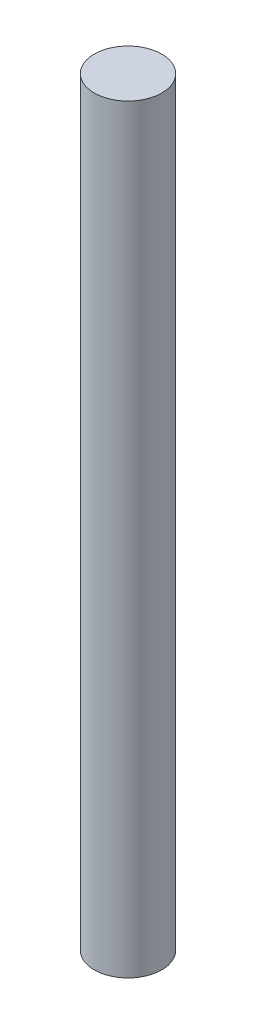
from build123d import *

# Parameters (mm, degrees)
SKETCH1_W = 2
SKETCH1_H = 45


with BuildPart() as part:
    # Sketch1 → Revolve-Thin1 (revolve)
    with BuildSketch(Plane.XY, mode=Mode.PRIVATE) as revolve_thin1_sk:
        with Locations((-1, 22.5)):
            Rectangle(SKETCH1_W, SKETCH1_H)
    revolve(revolve_thin1_sk.sketch.rotate(Axis((0, 0, 0), (0, 1, 0)), 270), axis=Axis((0, 0, 0), (0, 1, 0)))


solid = part.part
